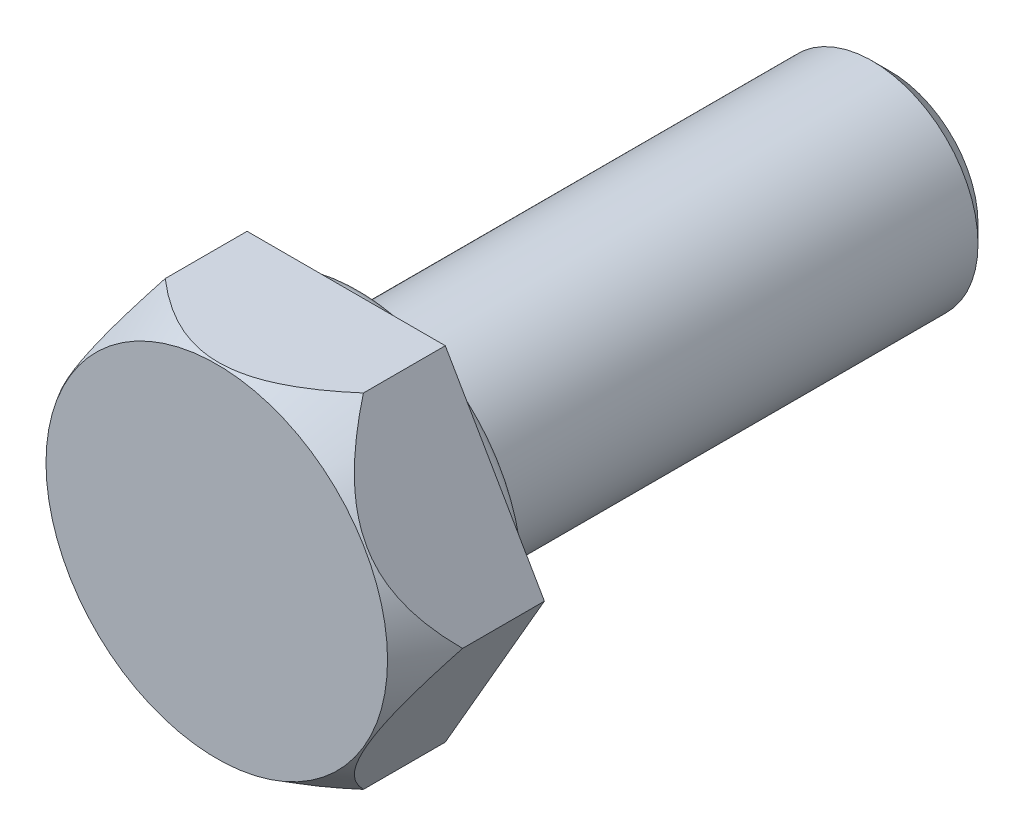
ISO-10303-21;
HEADER;
FILE_DESCRIPTION(('STEP AP214'),'2;1');
FILE_NAME('part.step','',(''),(''),'','','');
FILE_SCHEMA(('AUTOMOTIVE_DESIGN { 1 0 10303 214 1 1 1 1 }'));
ENDSEC;
DATA;
#1=APPLICATION_CONTEXT('core data for automotive mechanical design processes');
#2=APPLICATION_PROTOCOL_DEFINITION('international standard','automotive_design',2000,#1);
#3=PRODUCT_CONTEXT('',#1,'mechanical');
#4=PRODUCT('Part','Part','',(#3));
#5=PRODUCT_RELATED_PRODUCT_CATEGORY('part','',(#4));
#6=PRODUCT_DEFINITION_FORMATION('','',#4);
#7=PRODUCT_DEFINITION_CONTEXT('part definition',#1,'design');
#8=PRODUCT_DEFINITION('design','',#6,#7);
#9=PRODUCT_DEFINITION_SHAPE('','',#8);
#10=(LENGTH_UNIT() NAMED_UNIT(*) SI_UNIT(.MILLI.,.METRE.));
#11=(NAMED_UNIT(*) PLANE_ANGLE_UNIT() SI_UNIT($,.RADIAN.));
#12=(NAMED_UNIT(*) SI_UNIT($,.STERADIAN.) SOLID_ANGLE_UNIT());
#13=UNCERTAINTY_MEASURE_WITH_UNIT(LENGTH_MEASURE(1.E-05),#10,'distance_accuracy_value','');
#14=(GEOMETRIC_REPRESENTATION_CONTEXT(3) GLOBAL_UNCERTAINTY_ASSIGNED_CONTEXT((#13)) GLOBAL_UNIT_ASSIGNED_CONTEXT((#10,
#11,#12)) REPRESENTATION_CONTEXT('',''));
#15=CARTESIAN_POINT('',(0.,0.,0.));
#16=DIRECTION('',(0.,0.,1.));
#17=DIRECTION('',(1.,0.,0.));
#18=AXIS2_PLACEMENT_3D('',#15,#16,#17);
#19=CARTESIAN_POINT('',(0.,6.4,0.));
#20=DIRECTION('',(0.,0.,1.));
#21=DIRECTION('',(1.,0.,0.));
#22=AXIS2_PLACEMENT_3D('',#19,#20,#21);
#23=PLANE('',#22);
#24=CARTESIAN_POINT('',(0.,0.,0.));
#25=DIRECTION('',(0.,0.,1.));
#26=DIRECTION('',(1.,0.,0.));
#27=AXIS2_PLACEMENT_3D('',#24,#25,#26);
#28=CIRCLE('',#27,6.4);
#29=CARTESIAN_POINT('',(6.4,0.,0.));
#30=VERTEX_POINT('',#29);
#31=EDGE_CURVE('E259',#30,#30,#28,.T.);
#32=ORIENTED_EDGE('',*,*,#31,.T.);
#33=EDGE_LOOP('',(#32));
#34=FACE_BOUND('',#33,.T.);
#35=DIRECTION('',(-1.,0.,0.));
#36=VECTOR('',#35,1.);
#37=CARTESIAN_POINT('',(0.,-6.49999696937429,0.));
#38=LINE('',#37,#36);
#39=CARTESIAN_POINT('',(3.752775,-6.49999696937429,0.));
#40=VERTEX_POINT('',#39);
#41=CARTESIAN_POINT('',(-3.752775,-6.4999969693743,0.));
#42=VERTEX_POINT('',#41);
#43=EDGE_CURVE('E237',#40,#42,#38,.T.);
#44=ORIENTED_EDGE('',*,*,#43,.T.);
#45=DIRECTION('',(-0.5,0.866025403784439,0.));
#46=VECTOR('',#45,1.);
#47=CARTESIAN_POINT('',(-8.4004437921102,1.55000151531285,0.));
#48=LINE('',#47,#46);
#49=CARTESIAN_POINT('',(-7.50555,0.,0.));
#50=VERTEX_POINT('',#49);
#51=EDGE_CURVE('E105',#42,#50,#48,.T.);
#52=ORIENTED_EDGE('',*,*,#51,.T.);
#53=DIRECTION('',(0.5,0.866025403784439,0.));
#54=VECTOR('',#53,1.);
#55=CARTESIAN_POINT('',(-2.8578812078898,8.04999848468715,0.));
#56=LINE('',#55,#54);
#57=CARTESIAN_POINT('',(-3.752775,6.49999696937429,0.));
#58=VERTEX_POINT('',#57);
#59=EDGE_CURVE('E249',#50,#58,#56,.T.);
#60=ORIENTED_EDGE('',*,*,#59,.T.);
#61=DIRECTION('',(1.,0.,0.));
#62=VECTOR('',#61,1.);
#63=CARTESIAN_POINT('',(0.,6.4999969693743,0.));
#64=LINE('',#63,#62);
#65=CARTESIAN_POINT('',(3.752775,6.4999969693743,0.));
#66=VERTEX_POINT('',#65);
#67=EDGE_CURVE('E245',#58,#66,#64,.T.);
#68=ORIENTED_EDGE('',*,*,#67,.T.);
#69=DIRECTION('',(0.5,-0.866025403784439,0.));
#70=VECTOR('',#69,1.);
#71=CARTESIAN_POINT('',(2.8578812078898,8.04999848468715,0.));
#72=LINE('',#71,#70);
#73=CARTESIAN_POINT('',(7.50555,0.,0.));
#74=VERTEX_POINT('',#73);
#75=EDGE_CURVE('E242',#66,#74,#72,.T.);
#76=ORIENTED_EDGE('',*,*,#75,.T.);
#77=DIRECTION('',(-0.5,-0.866025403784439,0.));
#78=VECTOR('',#77,1.);
#79=CARTESIAN_POINT('',(8.4004437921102,1.55000151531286,0.));
#80=LINE('',#79,#78);
#81=EDGE_CURVE('E222',#74,#40,#80,.T.);
#82=ORIENTED_EDGE('',*,*,#81,.T.);
#83=EDGE_LOOP('',(#44,#52,#60,#68,#76,#82));
#84=FACE_BOUND('',#83,.T.);
#85=ADVANCED_FACE('F16',(#34,#84),#23,.F.);
#86=CARTESIAN_POINT('',(0.,0.,-20.6));
#87=DIRECTION('',(0.,0.,1.));
#88=DIRECTION('',(1.,0.,0.));
#89=AXIS2_PLACEMENT_3D('',#86,#87,#88);
#90=PLANE('',#89);
#91=CARTESIAN_POINT('',(0.,0.,-20.6));
#92=DIRECTION('',(0.,0.,1.));
#93=DIRECTION('',(1.,0.,0.));
#94=AXIS2_PLACEMENT_3D('',#91,#92,#93);
#95=CIRCLE('',#94,3.3234375);
#96=CARTESIAN_POINT('',(3.3234375,0.,-20.6));
#97=VERTEX_POINT('',#96);
#98=EDGE_CURVE('E98',#97,#97,#95,.T.);
#99=ORIENTED_EDGE('',*,*,#98,.F.);
#100=EDGE_LOOP('',(#99));
#101=FACE_BOUND('',#100,.T.);
#102=ADVANCED_FACE('F151',(#101),#90,.F.);
#103=CARTESIAN_POINT('',(0.,0.,-20.6));
#104=DIRECTION('',(0.,0.,1.));
#105=DIRECTION('',(1.,0.,0.));
#106=AXIS2_PLACEMENT_3D('',#103,#104,#105);
#107=CONICAL_SURFACE('',#106,3.3234375,0.785398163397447);
#108=CARTESIAN_POINT('',(0.,0.,-19.9234375));
#109=DIRECTION('',(0.,0.,1.));
#110=DIRECTION('',(1.,0.,0.));
#111=AXIS2_PLACEMENT_3D('',#108,#109,#110);
#112=CIRCLE('',#111,4.);
#113=CARTESIAN_POINT('',(4.,0.,-19.9234375));
#114=VERTEX_POINT('',#113);
#115=EDGE_CURVE('E179',#114,#114,#112,.T.);
#116=ORIENTED_EDGE('',*,*,#115,.F.);
#117=EDGE_LOOP('',(#116));
#118=FACE_BOUND('',#117,.T.);
#119=ORIENTED_EDGE('',*,*,#98,.T.);
#120=EDGE_LOOP('',(#119));
#121=FACE_BOUND('',#120,.T.);
#122=ADVANCED_FACE('F156',(#118,#121),#107,.T.);
#123=CARTESIAN_POINT('',(0.,0.,4.9));
#124=DIRECTION('',(0.,0.,1.));
#125=DIRECTION('',(1.,0.,0.));
#126=AXIS2_PLACEMENT_3D('',#123,#124,#125);
#127=CYLINDRICAL_SURFACE('',#126,4.);
#128=CARTESIAN_POINT('',(0.,0.,-1.));
#129=DIRECTION('',(0.,0.,1.));
#130=DIRECTION('',(1.,0.,0.));
#131=AXIS2_PLACEMENT_3D('',#128,#129,#130);
#132=CIRCLE('',#131,4.);
#133=CARTESIAN_POINT('',(4.,0.,-1.));
#134=VERTEX_POINT('',#133);
#135=EDGE_CURVE('E188',#134,#134,#132,.T.);
#136=ORIENTED_EDGE('',*,*,#135,.F.);
#137=EDGE_LOOP('',(#136));
#138=FACE_BOUND('',#137,.T.);
#139=ORIENTED_EDGE('',*,*,#115,.T.);
#140=EDGE_LOOP('',(#139));
#141=FACE_BOUND('',#140,.T.);
#142=ADVANCED_FACE('F167',(#138,#141),#127,.T.);
#143=CARTESIAN_POINT('',(0.,0.,-1.));
#144=DIRECTION('',(0.,0.,1.));
#145=DIRECTION('',(1.,0.,0.));
#146=AXIS2_PLACEMENT_3D('',#143,#144,#145);
#147=TOROIDAL_SURFACE('',#146,4.4,0.4);
#148=ORIENTED_EDGE('',*,*,#135,.T.);
#149=EDGE_LOOP('',(#148));
#150=FACE_BOUND('',#149,.T.);
#151=CARTESIAN_POINT('',(0.,0.,-0.6));
#152=DIRECTION('',(0.,0.,1.));
#153=DIRECTION('',(1.,0.,0.));
#154=AXIS2_PLACEMENT_3D('',#151,#152,#153);
#155=CIRCLE('',#154,4.4);
#156=CARTESIAN_POINT('',(4.4,0.,-0.6));
#157=VERTEX_POINT('',#156);
#158=EDGE_CURVE('E265',#157,#157,#155,.T.);
#159=ORIENTED_EDGE('',*,*,#158,.F.);
#160=EDGE_LOOP('',(#159));
#161=FACE_BOUND('',#160,.T.);
#162=ADVANCED_FACE('F163',(#150,#161),#147,.F.);
#163=CARTESIAN_POINT('',(0.,4.4,-0.6));
#164=DIRECTION('',(0.,0.,1.));
#165=DIRECTION('',(1.,0.,0.));
#166=AXIS2_PLACEMENT_3D('',#163,#164,#165);
#167=PLANE('',#166);
#168=CARTESIAN_POINT('',(0.,0.,-0.6));
#169=DIRECTION('',(0.,0.,1.));
#170=DIRECTION('',(1.,0.,0.));
#171=AXIS2_PLACEMENT_3D('',#168,#169,#170);
#172=CIRCLE('',#171,5.8);
#173=CARTESIAN_POINT('',(5.8,0.,-0.6));
#174=VERTEX_POINT('',#173);
#175=EDGE_CURVE('E261',#174,#174,#172,.T.);
#176=ORIENTED_EDGE('',*,*,#175,.F.);
#177=EDGE_LOOP('',(#176));
#178=FACE_BOUND('',#177,.T.);
#179=ORIENTED_EDGE('',*,*,#158,.T.);
#180=EDGE_LOOP('',(#179));
#181=FACE_BOUND('',#180,.T.);
#182=ADVANCED_FACE('F147',(#178,#181),#167,.F.);
#183=CARTESIAN_POINT('',(0.,0.,0.));
#184=DIRECTION('',(0.,0.,1.));
#185=DIRECTION('',(1.,0.,0.));
#186=AXIS2_PLACEMENT_3D('',#183,#184,#185);
#187=TOROIDAL_SURFACE('',#186,5.8,0.6);
#188=ORIENTED_EDGE('',*,*,#31,.F.);
#189=EDGE_LOOP('',(#188));
#190=FACE_BOUND('',#189,.T.);
#191=ORIENTED_EDGE('',*,*,#175,.T.);
#192=EDGE_LOOP('',(#191));
#193=FACE_BOUND('',#192,.T.);
#194=ADVANCED_FACE('F142',(#190,#193),#187,.T.);
#195=CARTESIAN_POINT('',(-3.752775,-6.4999969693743,-20.6));
#196=DIRECTION('',(0.866025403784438,0.5,0.));
#197=DIRECTION('',(0.5,-0.866025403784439,0.));
#198=AXIS2_PLACEMENT_3D('',#195,#196,#197);
#199=PLANE('',#198);
#200=ORIENTED_EDGE('',*,*,#51,.F.);
#201=DIRECTION('',(0.,0.,1.));
#202=VECTOR('',#201,1.);
#203=CARTESIAN_POINT('',(-3.752775,-6.4999969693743,-20.6));
#204=LINE('',#203,#202);
#205=CARTESIAN_POINT('',(-3.752775,-6.4999969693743,3.1));
#206=VERTEX_POINT('',#205);
#207=EDGE_CURVE('E42',#42,#206,#204,.T.);
#208=ORIENTED_EDGE('',*,*,#207,.T.);
#209=CARTESIAN_POINT('',(-7.50555115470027,1.99999953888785E-06,3.099998));
#210=CARTESIAN_POINT('',(-7.46629983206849,-0.0679832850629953,3.16797634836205));
#211=CARTESIAN_POINT('',(-7.42665683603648,-0.136646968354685,3.23504790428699));
#212=CARTESIAN_POINT('',(-7.34650128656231,-0.275480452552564,3.36712464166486));
#213=CARTESIAN_POINT('',(-7.30598848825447,-0.345650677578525,3.43212922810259));
#214=CARTESIAN_POINT('',(-7.18263245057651,-0.559309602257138,3.624255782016));
#215=CARTESIAN_POINT('',(-7.0983699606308,-0.70525651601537,3.74779218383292));
#216=CARTESIAN_POINT('',(-6.92328544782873,-1.008511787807,3.98525037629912));
#217=CARTESIAN_POINT('',(-6.83235020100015,-1.16601625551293,4.09884132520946));
#218=CARTESIAN_POINT('',(-6.64555360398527,-1.48955745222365,4.30791459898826));
#219=CARTESIAN_POINT('',(-6.54970376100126,-1.65557425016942,4.4034369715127));
#220=CARTESIAN_POINT('',(-6.3977890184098,-1.9186983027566,4.53249561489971));
#221=CARTESIAN_POINT('',(-6.343502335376,-2.01272559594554,4.57444053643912));
#222=CARTESIAN_POINT('',(-6.23350734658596,-2.20324250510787,4.65019797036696));
#223=CARTESIAN_POINT('',(-6.17779893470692,-2.29973230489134,4.68400987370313));
#224=CARTESIAN_POINT('',(-6.06562539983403,-2.49402256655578,4.74220859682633));
#225=CARTESIAN_POINT('',(-6.00916975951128,-2.59180660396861,4.76666791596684));
#226=CARTESIAN_POINT('',(-5.89540917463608,-2.78884571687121,4.80565421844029));
#227=CARTESIAN_POINT('',(-5.83810439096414,-2.88810051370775,4.82018305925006));
#228=CARTESIAN_POINT('',(-5.72253588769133,-3.08827103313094,4.83881419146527));
#229=CARTESIAN_POINT('',(-5.66426819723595,-3.18919363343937,4.84281920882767));
#230=CARTESIAN_POINT('',(-5.54780120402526,-3.39092038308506,4.8399485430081));
#231=CARTESIAN_POINT('',(-5.48960190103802,-3.49172453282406,4.83307289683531));
#232=CARTESIAN_POINT('',(-5.37363854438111,-3.69257895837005,4.80870962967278));
#233=CARTESIAN_POINT('',(-5.31587571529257,-3.79262711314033,4.79119892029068));
#234=CARTESIAN_POINT('',(-5.20130242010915,-3.99107388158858,4.74624030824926));
#235=CARTESIAN_POINT('',(-5.14449254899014,-4.08947146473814,4.71878642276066));
#236=CARTESIAN_POINT('',(-5.01593603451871,-4.31213787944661,4.64568121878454));
#237=CARTESIAN_POINT('',(-4.94461117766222,-4.43567615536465,4.59706464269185));
#238=CARTESIAN_POINT('',(-4.80442067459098,-4.67849322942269,4.4872333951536));
#239=CARTESIAN_POINT('',(-4.73555657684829,-4.7977693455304,4.42601094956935));
#240=CARTESIAN_POINT('',(-4.60012006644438,-5.03235226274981,4.29295380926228));
#241=CARTESIAN_POINT('',(-4.53355801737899,-5.14764111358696,4.22107730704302));
#242=CARTESIAN_POINT('',(-4.40293794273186,-5.37388171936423,4.06886648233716));
#243=CARTESIAN_POINT('',(-4.33887950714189,-5.48483418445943,3.9885335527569));
#244=CARTESIAN_POINT('',(-4.18381356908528,-5.7534162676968,3.78206900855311));
#245=CARTESIAN_POINT('',(-4.09411640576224,-5.90877631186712,3.65200268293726));
#246=CARTESIAN_POINT('',(-3.96327273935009,-6.13540418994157,3.44953049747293));
#247=CARTESIAN_POINT('',(-3.9205066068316,-6.20947730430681,3.38121734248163));
#248=CARTESIAN_POINT('',(-3.83594062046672,-6.35594988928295,3.24227150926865));
#249=CARTESIAN_POINT('',(-3.79414056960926,-6.42834970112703,3.17163931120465));
#250=CARTESIAN_POINT('',(-3.75277384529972,-6.49999896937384,3.099998));
#251=B_SPLINE_CURVE_WITH_KNOTS('',3,(#209,#210,#211,#212,#213,#214,#215,#216,#217,#218,#219,
#220,#221,#222,#223,#224,#225,#226,#227,#228,#229,#230,#231,#232,#233,#234,#235,#236,#237,#238,
#239,#240,#241,#242,#243,#244,#245,#246,#247,#248,#249,#250),.UNSPECIFIED.,.F.,.F.,(4,2,2,2,2,2,
2,2,2,2,2,2,2,2,2,2,2,2,2,2,4),(0.,0.311519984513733,0.623128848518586,1.24952093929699,
1.89209564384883,2.53322899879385,2.88214670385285,3.23109052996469,3.57727175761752,
3.92338821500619,4.27269282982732,4.62199625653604,4.97206073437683,5.32233619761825,
5.77371777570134,6.22537856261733,6.67886107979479,7.1322690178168,7.79638121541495,
8.12474701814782,8.45304525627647),.UNSPECIFIED.);
#252=CARTESIAN_POINT('',(-7.50555,0.,3.1));
#253=VERTEX_POINT('',#252);
#254=EDGE_CURVE('E10',#253,#206,#251,.T.);
#255=ORIENTED_EDGE('',*,*,#254,.F.);
#256=DIRECTION('',(0.,0.,1.));
#257=VECTOR('',#256,1.);
#258=CARTESIAN_POINT('',(-7.50555,0.,-20.6));
#259=LINE('',#258,#257);
#260=EDGE_CURVE('E234',#50,#253,#259,.T.);
#261=ORIENTED_EDGE('',*,*,#260,.F.);
#262=EDGE_LOOP('',(#200,#208,#255,#261));
#263=FACE_BOUND('',#262,.T.);
#264=ADVANCED_FACE('F101',(#263),#199,.F.);
#265=CARTESIAN_POINT('',(-7.50555,0.,-20.6));
#266=DIRECTION('',(0.866025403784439,-0.5,0.));
#267=DIRECTION('',(-0.5,-0.866025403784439,0.));
#268=AXIS2_PLACEMENT_3D('',#265,#266,#267);
#269=PLANE('',#268);
#270=ORIENTED_EDGE('',*,*,#59,.F.);
#271=ORIENTED_EDGE('',*,*,#260,.T.);
#272=CARTESIAN_POINT('',(-3.75277384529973,6.49999896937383,3.099998));
#273=CARTESIAN_POINT('',(-3.79202516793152,6.4320136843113,3.16797634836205));
#274=CARTESIAN_POINT('',(-3.83166816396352,6.36335000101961,3.235047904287));
#275=CARTESIAN_POINT('',(-3.9118237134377,6.22451651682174,3.36712464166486));
#276=CARTESIAN_POINT('',(-3.95233651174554,6.15434629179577,3.43212922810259));
#277=CARTESIAN_POINT('',(-4.0756925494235,5.94068736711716,3.62425578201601));
#278=CARTESIAN_POINT('',(-4.15995503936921,5.79474045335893,3.74779218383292));
#279=CARTESIAN_POINT('',(-4.33503955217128,5.49148518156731,3.98525037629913));
#280=CARTESIAN_POINT('',(-4.42597479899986,5.33398071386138,4.09884132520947));
#281=CARTESIAN_POINT('',(-4.61277139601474,5.01043951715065,4.30791459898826));
#282=CARTESIAN_POINT('',(-4.70862123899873,4.84442271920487,4.40343697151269));
#283=CARTESIAN_POINT('',(-4.8605359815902,4.5812986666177,4.5324956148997));
#284=CARTESIAN_POINT('',(-4.91482266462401,4.48727137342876,4.57444053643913));
#285=CARTESIAN_POINT('',(-5.02481765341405,4.29675446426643,4.65019797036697));
#286=CARTESIAN_POINT('',(-5.08052606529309,4.20026466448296,4.68400987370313));
#287=CARTESIAN_POINT('',(-5.19269960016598,4.00597440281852,4.74220859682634));
#288=CARTESIAN_POINT('',(-5.24915524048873,3.90819036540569,4.76666791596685));
#289=CARTESIAN_POINT('',(-5.36291582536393,3.71115125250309,4.8056542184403));
#290=CARTESIAN_POINT('',(-5.42022060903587,3.61189645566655,4.82018305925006));
#291=CARTESIAN_POINT('',(-5.53578911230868,3.41172593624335,4.83881419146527));
#292=CARTESIAN_POINT('',(-5.59405680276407,3.31080333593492,4.84281920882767));
#293=CARTESIAN_POINT('',(-5.71052379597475,3.10907658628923,4.83994854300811));
#294=CARTESIAN_POINT('',(-5.76872309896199,3.00827243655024,4.83307289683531));
#295=CARTESIAN_POINT('',(-5.8846864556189,2.80741801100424,4.80870962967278));
#296=CARTESIAN_POINT('',(-5.94244928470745,2.70736985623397,4.79119892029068));
#297=CARTESIAN_POINT('',(-6.05702257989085,2.50892308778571,4.74624030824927));
#298=CARTESIAN_POINT('',(-6.11383245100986,2.41052550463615,4.71878642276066));
#299=CARTESIAN_POINT('',(-6.24238896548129,2.18785908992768,4.64568121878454));
#300=CARTESIAN_POINT('',(-6.31371382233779,2.06432081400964,4.59706464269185));
#301=CARTESIAN_POINT('',(-6.45390432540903,1.8215037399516,4.4872333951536));
#302=CARTESIAN_POINT('',(-6.52276842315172,1.70222762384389,4.42601094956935));
#303=CARTESIAN_POINT('',(-6.65820493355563,1.46764470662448,4.29295380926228));
#304=CARTESIAN_POINT('',(-6.72476698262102,1.35235585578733,4.22107730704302));
#305=CARTESIAN_POINT('',(-6.85538705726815,1.12611525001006,4.06886648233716));
#306=CARTESIAN_POINT('',(-6.91944549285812,1.01516278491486,3.98853355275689));
#307=CARTESIAN_POINT('',(-7.07451143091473,0.746580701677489,3.7820690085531));
#308=CARTESIAN_POINT('',(-7.16420859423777,0.591220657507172,3.65200268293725));
#309=CARTESIAN_POINT('',(-7.29505226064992,0.364592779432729,3.44953049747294));
#310=CARTESIAN_POINT('',(-7.33781839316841,0.290519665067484,3.38121734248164));
#311=CARTESIAN_POINT('',(-7.42238437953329,0.144047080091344,3.24227150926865));
#312=CARTESIAN_POINT('',(-7.46418443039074,0.0716472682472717,3.17163931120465));
#313=CARTESIAN_POINT('',(-7.50555115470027,-1.99999953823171E-06,3.099998));
#314=B_SPLINE_CURVE_WITH_KNOTS('',3,(#272,#273,#274,#275,#276,#277,#278,#279,#280,#281,#282,
#283,#284,#285,#286,#287,#288,#289,#290,#291,#292,#293,#294,#295,#296,#297,#298,#299,#300,#301,
#302,#303,#304,#305,#306,#307,#308,#309,#310,#311,#312,#313),.UNSPECIFIED.,.F.,.F.,(4,2,2,2,2,2,
2,2,2,2,2,2,2,2,2,2,2,2,2,2,4),(0.,0.311519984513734,0.623128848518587,1.24952093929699,
1.89209564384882,2.53322899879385,2.88214670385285,3.23109052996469,3.57727175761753,
3.9233882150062,4.27269282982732,4.62199625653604,4.97206073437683,5.32233619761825,
5.77371777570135,6.22537856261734,6.6788610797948,7.13226901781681,7.79638121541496,
8.12474701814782,8.45304525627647),.UNSPECIFIED.);
#315=CARTESIAN_POINT('',(-3.752775,6.49999696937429,3.1));
#316=VERTEX_POINT('',#315);
#317=EDGE_CURVE('E30',#316,#253,#314,.T.);
#318=ORIENTED_EDGE('',*,*,#317,.F.);
#319=DIRECTION('',(0.,0.,1.));
#320=VECTOR('',#319,1.);
#321=CARTESIAN_POINT('',(-3.752775,6.49999696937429,-20.6));
#322=LINE('',#321,#320);
#323=EDGE_CURVE('E229',#58,#316,#322,.T.);
#324=ORIENTED_EDGE('',*,*,#323,.F.);
#325=EDGE_LOOP('',(#270,#271,#318,#324));
#326=FACE_BOUND('',#325,.T.);
#327=ADVANCED_FACE('F134',(#326),#269,.F.);
#328=CARTESIAN_POINT('',(-3.752775,6.49999696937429,-20.6));
#329=DIRECTION('',(0.,-1.,0.));
#330=DIRECTION('',(-1.,0.,0.));
#331=AXIS2_PLACEMENT_3D('',#328,#329,#330);
#332=PLANE('',#331);
#333=ORIENTED_EDGE('',*,*,#67,.F.);
#334=ORIENTED_EDGE('',*,*,#323,.T.);
#335=CARTESIAN_POINT('',(-6.52280699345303,6.49999696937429,0.15035710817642));
#336=CARTESIAN_POINT('',(-6.38753084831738,6.49999696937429,0.316289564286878));
#337=CARTESIAN_POINT('',(-6.25102197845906,6.49999696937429,0.481232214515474));
#338=CARTESIAN_POINT('',(-5.97506181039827,6.49999696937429,0.808710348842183));
#339=CARTESIAN_POINT('',(-5.83560973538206,6.49999696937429,0.97124517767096));
#340=CARTESIAN_POINT('',(-5.55204366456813,6.49999696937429,1.29489103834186));
#341=CARTESIAN_POINT('',(-5.4078983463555,6.49999696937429,1.45597471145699));
#342=CARTESIAN_POINT('',(-5.11563612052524,6.49999696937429,1.77447985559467));
#343=CARTESIAN_POINT('',(-4.96751958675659,6.49999696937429,1.93190166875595));
#344=CARTESIAN_POINT('',(-4.65691681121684,6.49999696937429,2.25222162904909));
#345=CARTESIAN_POINT('',(-4.49411947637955,6.49999696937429,2.41481949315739));
#346=CARTESIAN_POINT('',(-4.16215243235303,6.49999696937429,2.73350194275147));
#347=CARTESIAN_POINT('',(-3.99298112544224,6.49999696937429,2.88958487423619));
#348=CARTESIAN_POINT('',(-3.64772754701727,6.49999696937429,3.19257741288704));
#349=CARTESIAN_POINT('',(-3.47167461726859,6.49999696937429,3.33952024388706));
#350=CARTESIAN_POINT('',(-3.11068304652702,6.49999696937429,3.62196877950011));
#351=CARTESIAN_POINT('',(-2.92575052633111,6.49999696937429,3.75748218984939));
#352=CARTESIAN_POINT('',(-2.61064659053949,6.49999696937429,3.96918045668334));
#353=CARTESIAN_POINT('',(-2.48344395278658,6.49999696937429,4.04977445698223));
#354=CARTESIAN_POINT('',(-2.22408042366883,6.49999696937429,4.2027316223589));
#355=CARTESIAN_POINT('',(-2.09191794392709,6.49999696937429,4.27509212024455));
#356=CARTESIAN_POINT('',(-1.82376168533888,6.49999696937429,4.40900404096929));
#357=CARTESIAN_POINT('',(-1.68781668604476,6.49999696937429,4.47065229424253));
#358=CARTESIAN_POINT('',(-1.41104011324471,6.49999696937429,4.58180293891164));
#359=CARTESIAN_POINT('',(-1.27021079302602,6.49999696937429,4.63131084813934));
#360=CARTESIAN_POINT('',(-1.02152860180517,6.49999696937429,4.70491288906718));
#361=CARTESIAN_POINT('',(-0.914639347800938,6.49999696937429,4.73226771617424));
#362=CARTESIAN_POINT('',(-0.69901159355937,6.49999696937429,4.77827029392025));
#363=CARTESIAN_POINT('',(-0.590273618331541,6.49999696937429,4.79692047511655));
#364=CARTESIAN_POINT('',(-0.371615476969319,6.49999696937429,4.82486510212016));
#365=CARTESIAN_POINT('',(-0.261695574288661,6.49999696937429,4.83416159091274));
#366=CARTESIAN_POINT('',(-0.0414583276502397,6.49999696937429,4.84305482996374));
#367=CARTESIAN_POINT('',(0.0688590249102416,6.4999969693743,4.84265136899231));
#368=CARTESIAN_POINT('',(0.28897518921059,6.4999969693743,4.83215808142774));
#369=CARTESIAN_POINT('',(0.398774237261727,6.49999696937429,4.82207320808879));
#370=CARTESIAN_POINT('',(0.617134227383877,6.49999696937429,4.79261553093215));
#371=CARTESIAN_POINT('',(0.725694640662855,6.49999696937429,4.7732389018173));
#372=CARTESIAN_POINT('',(1.04856246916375,6.49999696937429,4.70209857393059));
#373=CARTESIAN_POINT('',(1.2600854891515,6.4999969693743,4.63732277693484));
#374=CARTESIAN_POINT('',(1.62992332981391,6.4999969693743,4.49643063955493));
#375=CARTESIAN_POINT('',(1.79025807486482,6.49999696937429,4.42535961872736));
#376=CARTESIAN_POINT('',(2.1041253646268,6.49999696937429,4.26934812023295));
#377=CARTESIAN_POINT('',(2.2576531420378,6.49999696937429,4.18439811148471));
#378=CARTESIAN_POINT('',(2.55975925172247,6.49999696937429,4.00263691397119));
#379=CARTESIAN_POINT('',(2.70826410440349,6.49999696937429,3.90570498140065));
#380=CARTESIAN_POINT('',(2.92639514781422,6.49999696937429,3.75382056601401));
#381=CARTESIAN_POINT('',(2.99832114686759,6.49999696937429,3.70212184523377));
#382=CARTESIAN_POINT('',(3.14073898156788,6.49999696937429,3.59678764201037));
#383=CARTESIAN_POINT('',(3.21123085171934,6.4999969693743,3.54315220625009));
#384=CARTESIAN_POINT('',(3.43349967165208,6.4999969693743,3.36967592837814));
#385=CARTESIAN_POINT('',(3.58275558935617,6.49999696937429,3.24659665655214));
#386=CARTESIAN_POINT('',(3.87577002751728,6.49999696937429,2.99403182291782));
#387=CARTESIAN_POINT('',(4.01952690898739,6.49999696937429,2.86454437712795));
#388=CARTESIAN_POINT('',(4.30242753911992,6.49999696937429,2.60036720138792));
#389=CARTESIAN_POINT('',(4.44156659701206,6.49999696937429,2.46567246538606));
#390=CARTESIAN_POINT('',(4.71576056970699,6.49999696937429,2.19217588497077));
#391=CARTESIAN_POINT('',(4.85081505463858,6.49999696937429,2.05337361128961));
#392=CARTESIAN_POINT('',(5.11813739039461,6.49999696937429,1.77163295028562));
#393=CARTESIAN_POINT('',(5.25038530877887,6.49999696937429,1.6286756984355));
#394=CARTESIAN_POINT('',(5.51178391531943,6.49999696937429,1.33995253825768));
#395=CARTESIAN_POINT('',(5.64093445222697,6.49999696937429,1.19418649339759));
#396=CARTESIAN_POINT('',(6.02419918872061,6.49999696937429,0.753565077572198));
#397=CARTESIAN_POINT('',(6.27429200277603,6.49999696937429,0.455209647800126));
#398=CARTESIAN_POINT('',(6.74157892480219,6.49999696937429,-0.118009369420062));
#399=CARTESIAN_POINT('',(6.95956083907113,6.49999696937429,-0.392236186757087));
#400=CARTESIAN_POINT('',(7.39014500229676,6.49999696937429,-0.944944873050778));
#401=CARTESIAN_POINT('',(7.60274640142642,6.49999696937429,-1.2234274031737));
#402=CARTESIAN_POINT('',(8.02091577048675,6.49999696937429,-1.7802206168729));
#403=CARTESIAN_POINT('',(8.22653830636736,6.49999696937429,-2.05849045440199));
#404=CARTESIAN_POINT('',(8.63411321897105,6.49999696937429,-2.61758757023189));
#405=CARTESIAN_POINT('',(8.83606661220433,6.49999696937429,-2.89841410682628));
#406=CARTESIAN_POINT('',(9.03656318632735,6.4999969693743,-3.18026291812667));
#407=B_SPLINE_CURVE_WITH_KNOTS('',3,(#335,#336,#337,#338,#339,#340,#341,#342,#343,#344,#345,
#346,#347,#348,#349,#350,#351,#352,#353,#354,#355,#356,#357,#358,#359,#360,#361,#362,#363,#364,
#365,#366,#367,#368,#369,#370,#371,#372,#373,#374,#375,#376,#377,#378,#379,#380,#381,#382,#383,
#384,#385,#386,#387,#388,#389,#390,#391,#392,#393,#394,#395,#396,#397,#398,#399,#400,#401,#402,
#403,#404,#405,#406),.UNSPECIFIED.,.F.,.F.,(4,2,2,2,2,2,2,2,2,2,2,2,2,2,2,2,2,2,2,2,2,2,2,2,2,2,
2,2,2,2,2,2,2,2,2,4),(0.,0.642272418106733,1.28471652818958,1.93314400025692,2.58151064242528,
3.27163533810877,3.96193418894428,4.64955632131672,5.33671108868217,5.78822218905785,
6.23987913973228,6.68721302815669,7.13434322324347,7.46502623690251,7.79561686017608,
8.12613526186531,8.45666086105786,8.78701744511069,9.11751014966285,9.77840943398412,
10.3038539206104,10.8296607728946,11.3612804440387,11.6269886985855,11.8926905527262,
12.472806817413,13.0530946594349,13.6339549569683,14.2148761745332,14.7990629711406,
15.3832782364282,16.5509828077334,17.6018395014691,18.6528611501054,19.6908255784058,
20.7284979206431),.UNSPECIFIED.);
#408=CARTESIAN_POINT('',(3.752775,6.4999969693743,3.1));
#409=VERTEX_POINT('',#408);
#410=EDGE_CURVE('E113',#409,#316,#407,.F.);
#411=ORIENTED_EDGE('',*,*,#410,.F.);
#412=DIRECTION('',(0.,0.,1.));
#413=VECTOR('',#412,1.);
#414=CARTESIAN_POINT('',(3.752775,6.4999969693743,-20.6));
#415=LINE('',#414,#413);
#416=EDGE_CURVE('E224',#66,#409,#415,.T.);
#417=ORIENTED_EDGE('',*,*,#416,.F.);
#418=EDGE_LOOP('',(#333,#334,#411,#417));
#419=FACE_BOUND('',#418,.T.);
#420=ADVANCED_FACE('F137',(#419),#332,.F.);
#421=CARTESIAN_POINT('',(3.752775,6.4999969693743,-20.6));
#422=DIRECTION('',(-0.866025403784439,-0.5,0.));
#423=DIRECTION('',(-0.5,0.866025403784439,0.));
#424=AXIS2_PLACEMENT_3D('',#421,#422,#423);
#425=PLANE('',#424);
#426=ORIENTED_EDGE('',*,*,#75,.F.);
#427=ORIENTED_EDGE('',*,*,#416,.T.);
#428=CARTESIAN_POINT('',(7.50555115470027,-1.99999953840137E-06,3.099998));
#429=CARTESIAN_POINT('',(7.46629983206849,0.0679832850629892,3.16797634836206));
#430=CARTESIAN_POINT('',(7.42665683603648,0.136646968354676,3.235047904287));
#431=CARTESIAN_POINT('',(7.3465012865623,0.275480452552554,3.36712464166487));
#432=CARTESIAN_POINT('',(7.30598848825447,0.345650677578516,3.4321292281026));
#433=CARTESIAN_POINT('',(7.1826324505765,0.55930960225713,3.62425578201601));
#434=CARTESIAN_POINT('',(7.09836996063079,0.705256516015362,3.74779218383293));
#435=CARTESIAN_POINT('',(6.92328544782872,1.00851178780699,3.98525037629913));
#436=CARTESIAN_POINT('',(6.83235020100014,1.16601625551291,4.09884132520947));
#437=CARTESIAN_POINT('',(6.64555360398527,1.48955745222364,4.30791459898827));
#438=CARTESIAN_POINT('',(6.54970376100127,1.65557425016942,4.4034369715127));
#439=CARTESIAN_POINT('',(6.3977890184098,1.9186983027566,4.53249561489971));
#440=CARTESIAN_POINT('',(6.34350233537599,2.01272559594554,4.57444053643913));
#441=CARTESIAN_POINT('',(6.23350734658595,2.20324250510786,4.65019797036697));
#442=CARTESIAN_POINT('',(6.17779893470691,2.29973230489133,4.68400987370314));
#443=CARTESIAN_POINT('',(6.06562539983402,2.49402256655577,4.74220859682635));
#444=CARTESIAN_POINT('',(6.00916975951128,2.5918066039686,4.76666791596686));
#445=CARTESIAN_POINT('',(5.89540917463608,2.7888457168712,4.8056542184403));
#446=CARTESIAN_POINT('',(5.83810439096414,2.88810051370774,4.82018305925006));
#447=CARTESIAN_POINT('',(5.72253588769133,3.08827103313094,4.83881419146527));
#448=CARTESIAN_POINT('',(5.66426819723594,3.18919363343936,4.84281920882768));
#449=CARTESIAN_POINT('',(5.54780120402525,3.39092038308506,4.83994854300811));
#450=CARTESIAN_POINT('',(5.48960190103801,3.49172453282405,4.83307289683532));
#451=CARTESIAN_POINT('',(5.3736385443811,3.69257895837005,4.80870962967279));
#452=CARTESIAN_POINT('',(5.31587571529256,3.79262711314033,4.79119892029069));
#453=CARTESIAN_POINT('',(5.20130242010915,3.99107388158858,4.74624030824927));
#454=CARTESIAN_POINT('',(5.14449254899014,4.08947146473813,4.71878642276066));
#455=CARTESIAN_POINT('',(5.01593603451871,4.31213787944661,4.64568121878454));
#456=CARTESIAN_POINT('',(4.94461117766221,4.43567615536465,4.59706464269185));
#457=CARTESIAN_POINT('',(4.80442067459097,4.67849322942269,4.48723339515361));
#458=CARTESIAN_POINT('',(4.73555657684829,4.79776934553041,4.42601094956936));
#459=CARTESIAN_POINT('',(4.60012006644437,5.03235226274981,4.29295380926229));
#460=CARTESIAN_POINT('',(4.53355801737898,5.14764111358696,4.22107730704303));
#461=CARTESIAN_POINT('',(4.40293794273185,5.37388171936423,4.06886648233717));
#462=CARTESIAN_POINT('',(4.33887950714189,5.48483418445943,3.9885335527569));
#463=CARTESIAN_POINT('',(4.18381356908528,5.7534162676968,3.7820690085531));
#464=CARTESIAN_POINT('',(4.09411640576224,5.90877631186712,3.65200268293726));
#465=CARTESIAN_POINT('',(3.96327273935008,6.13540418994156,3.44953049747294));
#466=CARTESIAN_POINT('',(3.92050660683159,6.20947730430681,3.38121734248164));
#467=CARTESIAN_POINT('',(3.83594062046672,6.35594988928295,3.24227150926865));
#468=CARTESIAN_POINT('',(3.79414056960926,6.42834970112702,3.17163931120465));
#469=CARTESIAN_POINT('',(3.75277384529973,6.49999896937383,3.099998));
#470=B_SPLINE_CURVE_WITH_KNOTS('',3,(#428,#429,#430,#431,#432,#433,#434,#435,#436,#437,#438,
#439,#440,#441,#442,#443,#444,#445,#446,#447,#448,#449,#450,#451,#452,#453,#454,#455,#456,#457,
#458,#459,#460,#461,#462,#463,#464,#465,#466,#467,#468,#469),.UNSPECIFIED.,.F.,.F.,(4,2,2,2,2,2,
2,2,2,2,2,2,2,2,2,2,2,2,2,2,4),(0.,0.311519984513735,0.62312884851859,1.24952093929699,
1.89209564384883,2.53322899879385,2.88214670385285,3.23109052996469,3.57727175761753,
3.92338821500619,4.27269282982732,4.62199625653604,4.97206073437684,5.32233619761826,
5.77371777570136,6.22537856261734,6.6788610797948,7.13226901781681,7.79638121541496,
8.12474701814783,8.45304525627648),.UNSPECIFIED.);
#471=CARTESIAN_POINT('',(7.50555,0.,3.1));
#472=VERTEX_POINT('',#471);
#473=EDGE_CURVE('E121',#472,#409,#470,.T.);
#474=ORIENTED_EDGE('',*,*,#473,.F.);
#475=DIRECTION('',(0.,0.,1.));
#476=VECTOR('',#475,1.);
#477=CARTESIAN_POINT('',(7.50555,0.,-20.6));
#478=LINE('',#477,#476);
#479=EDGE_CURVE('E221',#74,#472,#478,.T.);
#480=ORIENTED_EDGE('',*,*,#479,.F.);
#481=EDGE_LOOP('',(#426,#427,#474,#480));
#482=FACE_BOUND('',#481,.T.);
#483=ADVANCED_FACE('F205',(#482),#425,.F.);
#484=CARTESIAN_POINT('',(7.50555,0.,-20.6));
#485=DIRECTION('',(-0.866025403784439,0.5,0.));
#486=DIRECTION('',(0.5,0.866025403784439,0.));
#487=AXIS2_PLACEMENT_3D('',#484,#485,#486);
#488=PLANE('',#487);
#489=ORIENTED_EDGE('',*,*,#81,.F.);
#490=ORIENTED_EDGE('',*,*,#479,.T.);
#491=CARTESIAN_POINT('',(3.75277384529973,-6.49999896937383,3.099998));
#492=CARTESIAN_POINT('',(3.79202516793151,-6.4320136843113,3.16797634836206));
#493=CARTESIAN_POINT('',(3.83166816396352,-6.36335000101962,3.235047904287));
#494=CARTESIAN_POINT('',(3.9118237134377,-6.22451651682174,3.36712464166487));
#495=CARTESIAN_POINT('',(3.95233651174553,-6.15434629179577,3.4321292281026));
#496=CARTESIAN_POINT('',(4.0756925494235,-5.94068736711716,3.62425578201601));
#497=CARTESIAN_POINT('',(4.15995503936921,-5.79474045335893,3.74779218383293));
#498=CARTESIAN_POINT('',(4.33503955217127,-5.49148518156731,3.98525037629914));
#499=CARTESIAN_POINT('',(4.42597479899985,-5.33398071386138,4.09884132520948));
#500=CARTESIAN_POINT('',(4.61277139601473,-5.01043951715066,4.30791459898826));
#501=CARTESIAN_POINT('',(4.70862123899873,-4.84442271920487,4.40343697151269));
#502=CARTESIAN_POINT('',(4.8605359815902,-4.5812986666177,4.5324956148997));
#503=CARTESIAN_POINT('',(4.914822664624,-4.48727137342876,4.57444053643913));
#504=CARTESIAN_POINT('',(5.02481765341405,-4.29675446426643,4.65019797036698));
#505=CARTESIAN_POINT('',(5.08052606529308,-4.20026466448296,4.68400987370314));
#506=CARTESIAN_POINT('',(5.19269960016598,-4.00597440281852,4.74220859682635));
#507=CARTESIAN_POINT('',(5.24915524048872,-3.90819036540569,4.76666791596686));
#508=CARTESIAN_POINT('',(5.36291582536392,-3.71115125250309,4.80565421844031));
#509=CARTESIAN_POINT('',(5.42022060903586,-3.61189645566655,4.82018305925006));
#510=CARTESIAN_POINT('',(5.53578911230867,-3.41172593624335,4.83881419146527));
#511=CARTESIAN_POINT('',(5.59405680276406,-3.31080333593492,4.84281920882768));
#512=CARTESIAN_POINT('',(5.71052379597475,-3.10907658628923,4.83994854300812));
#513=CARTESIAN_POINT('',(5.76872309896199,-3.00827243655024,4.83307289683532));
#514=CARTESIAN_POINT('',(5.8846864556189,-2.80741801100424,4.80870962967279));
#515=CARTESIAN_POINT('',(5.94244928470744,-2.70736985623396,4.7911989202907));
#516=CARTESIAN_POINT('',(6.05702257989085,-2.50892308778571,4.74624030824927));
#517=CARTESIAN_POINT('',(6.11383245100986,-2.41052550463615,4.71878642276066));
#518=CARTESIAN_POINT('',(6.24238896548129,-2.18785908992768,4.64568121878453));
#519=CARTESIAN_POINT('',(6.31371382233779,-2.06432081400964,4.59706464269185));
#520=CARTESIAN_POINT('',(6.45390432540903,-1.8215037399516,4.48723339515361));
#521=CARTESIAN_POINT('',(6.52276842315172,-1.70222762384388,4.42601094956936));
#522=CARTESIAN_POINT('',(6.65820493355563,-1.46764470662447,4.29295380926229));
#523=CARTESIAN_POINT('',(6.72476698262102,-1.35235585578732,4.22107730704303));
#524=CARTESIAN_POINT('',(6.85538705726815,-1.12611525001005,4.06886648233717));
#525=CARTESIAN_POINT('',(6.91944549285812,-1.01516278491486,3.9885335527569));
#526=CARTESIAN_POINT('',(7.07451143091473,-0.74658070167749,3.7820690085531));
#527=CARTESIAN_POINT('',(7.16420859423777,-0.591220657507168,3.65200268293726));
#528=CARTESIAN_POINT('',(7.29505226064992,-0.364592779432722,3.44953049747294));
#529=CARTESIAN_POINT('',(7.33781839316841,-0.290519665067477,3.38121734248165));
#530=CARTESIAN_POINT('',(7.42238437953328,-0.144047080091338,3.24227150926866));
#531=CARTESIAN_POINT('',(7.46418443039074,-0.0716472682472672,3.17163931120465));
#532=CARTESIAN_POINT('',(7.50555115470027,1.99999954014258E-06,3.099998));
#533=B_SPLINE_CURVE_WITH_KNOTS('',3,(#491,#492,#493,#494,#495,#496,#497,#498,#499,#500,#501,
#502,#503,#504,#505,#506,#507,#508,#509,#510,#511,#512,#513,#514,#515,#516,#517,#518,#519,#520,
#521,#522,#523,#524,#525,#526,#527,#528,#529,#530,#531,#532),.UNSPECIFIED.,.F.,.F.,(4,2,2,2,2,2,
2,2,2,2,2,2,2,2,2,2,2,2,2,2,4),(0.,0.311519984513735,0.623128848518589,1.24952093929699,
1.89209564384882,2.53322899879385,2.88214670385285,3.23109052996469,3.57727175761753,
3.9233882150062,4.27269282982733,4.62199625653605,4.97206073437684,5.32233619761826,
5.77371777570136,6.22537856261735,6.67886107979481,7.13226901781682,7.79638121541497,
8.12474701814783,8.45304525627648),.UNSPECIFIED.);
#534=CARTESIAN_POINT('',(3.752775,-6.49999696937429,3.1));
#535=VERTEX_POINT('',#534);
#536=EDGE_CURVE('E97',#535,#472,#533,.T.);
#537=ORIENTED_EDGE('',*,*,#536,.F.);
#538=DIRECTION('',(0.,0.,1.));
#539=VECTOR('',#538,1.);
#540=CARTESIAN_POINT('',(3.752775,-6.49999696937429,-20.6));
#541=LINE('',#540,#539);
#542=EDGE_CURVE('E51',#40,#535,#541,.T.);
#543=ORIENTED_EDGE('',*,*,#542,.F.);
#544=EDGE_LOOP('',(#489,#490,#537,#543));
#545=FACE_BOUND('',#544,.T.);
#546=ADVANCED_FACE('F202',(#545),#488,.F.);
#547=CARTESIAN_POINT('',(3.752775,-6.49999696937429,-20.6));
#548=DIRECTION('',(0.,1.,0.));
#549=DIRECTION('',(1.,0.,0.));
#550=AXIS2_PLACEMENT_3D('',#547,#548,#549);
#551=PLANE('',#550);
#552=ORIENTED_EDGE('',*,*,#43,.F.);
#553=ORIENTED_EDGE('',*,*,#542,.T.);
#554=CARTESIAN_POINT('',(-6.52280699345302,-6.4999969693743,0.150357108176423));
#555=CARTESIAN_POINT('',(-6.38753084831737,-6.4999969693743,0.316289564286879));
#556=CARTESIAN_POINT('',(-6.25102197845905,-6.4999969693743,0.481232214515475));
#557=CARTESIAN_POINT('',(-5.97506181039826,-6.4999969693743,0.808710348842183));
#558=CARTESIAN_POINT('',(-5.83560973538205,-6.4999969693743,0.97124517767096));
#559=CARTESIAN_POINT('',(-5.55204366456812,-6.4999969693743,1.29489103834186));
#560=CARTESIAN_POINT('',(-5.40789834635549,-6.4999969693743,1.45597471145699));
#561=CARTESIAN_POINT('',(-5.11563612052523,-6.4999969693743,1.77447985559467));
#562=CARTESIAN_POINT('',(-4.96751958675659,-6.4999969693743,1.93190166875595));
#563=CARTESIAN_POINT('',(-4.65691681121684,-6.4999969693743,2.25222162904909));
#564=CARTESIAN_POINT('',(-4.49411947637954,-6.4999969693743,2.41481949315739));
#565=CARTESIAN_POINT('',(-4.16215243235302,-6.4999969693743,2.73350194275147));
#566=CARTESIAN_POINT('',(-3.99298112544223,-6.4999969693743,2.88958487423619));
#567=CARTESIAN_POINT('',(-3.64772754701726,-6.49999696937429,3.19257741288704));
#568=CARTESIAN_POINT('',(-3.47167461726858,-6.49999696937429,3.33952024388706));
#569=CARTESIAN_POINT('',(-3.11068304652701,-6.4999969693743,3.62196877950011));
#570=CARTESIAN_POINT('',(-2.9257505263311,-6.4999969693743,3.75748218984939));
#571=CARTESIAN_POINT('',(-2.61064659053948,-6.4999969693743,3.96918045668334));
#572=CARTESIAN_POINT('',(-2.48344395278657,-6.49999696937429,4.04977445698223));
#573=CARTESIAN_POINT('',(-2.22408042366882,-6.49999696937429,4.2027316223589));
#574=CARTESIAN_POINT('',(-2.09191794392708,-6.49999696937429,4.27509212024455));
#575=CARTESIAN_POINT('',(-1.82376168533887,-6.49999696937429,4.40900404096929));
#576=CARTESIAN_POINT('',(-1.68781668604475,-6.49999696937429,4.47065229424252));
#577=CARTESIAN_POINT('',(-1.41104011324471,-6.4999969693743,4.58180293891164));
#578=CARTESIAN_POINT('',(-1.27021079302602,-6.4999969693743,4.63131084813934));
#579=CARTESIAN_POINT('',(-1.02152860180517,-6.4999969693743,4.70491288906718));
#580=CARTESIAN_POINT('',(-0.91463934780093,-6.49999696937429,4.73226771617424));
#581=CARTESIAN_POINT('',(-0.699011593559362,-6.49999696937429,4.77827029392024));
#582=CARTESIAN_POINT('',(-0.590273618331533,-6.49999696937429,4.79692047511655));
#583=CARTESIAN_POINT('',(-0.371615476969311,-6.49999696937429,4.82486510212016));
#584=CARTESIAN_POINT('',(-0.261695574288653,-6.49999696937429,4.83416159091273));
#585=CARTESIAN_POINT('',(-0.0414583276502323,-6.49999696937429,4.84305482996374));
#586=CARTESIAN_POINT('',(0.0688590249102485,-6.49999696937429,4.84265136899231));
#587=CARTESIAN_POINT('',(0.288975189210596,-6.49999696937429,4.83215808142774));
#588=CARTESIAN_POINT('',(0.398774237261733,-6.49999696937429,4.82207320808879));
#589=CARTESIAN_POINT('',(0.617134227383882,-6.49999696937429,4.79261553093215));
#590=CARTESIAN_POINT('',(0.72569464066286,-6.49999696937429,4.77323890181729));
#591=CARTESIAN_POINT('',(1.04856246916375,-6.49999696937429,4.70209857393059));
#592=CARTESIAN_POINT('',(1.26008548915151,-6.49999696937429,4.63732277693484));
#593=CARTESIAN_POINT('',(1.62992332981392,-6.49999696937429,4.49643063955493));
#594=CARTESIAN_POINT('',(1.79025807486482,-6.49999696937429,4.42535961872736));
#595=CARTESIAN_POINT('',(2.1041253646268,-6.49999696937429,4.26934812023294));
#596=CARTESIAN_POINT('',(2.2576531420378,-6.49999696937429,4.18439811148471));
#597=CARTESIAN_POINT('',(2.55975925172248,-6.49999696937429,4.00263691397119));
#598=CARTESIAN_POINT('',(2.70826410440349,-6.49999696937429,3.90570498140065));
#599=CARTESIAN_POINT('',(2.92639514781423,-6.49999696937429,3.75382056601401));
#600=CARTESIAN_POINT('',(2.99832114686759,-6.49999696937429,3.70212184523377));
#601=CARTESIAN_POINT('',(3.14073898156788,-6.49999696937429,3.59678764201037));
#602=CARTESIAN_POINT('',(3.21123085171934,-6.49999696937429,3.5431522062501));
#603=CARTESIAN_POINT('',(3.43349967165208,-6.49999696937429,3.36967592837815));
#604=CARTESIAN_POINT('',(3.58275558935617,-6.49999696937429,3.24659665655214));
#605=CARTESIAN_POINT('',(3.87577002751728,-6.49999696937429,2.99403182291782));
#606=CARTESIAN_POINT('',(4.01952690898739,-6.49999696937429,2.86454437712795));
#607=CARTESIAN_POINT('',(4.30242753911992,-6.49999696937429,2.60036720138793));
#608=CARTESIAN_POINT('',(4.44156659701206,-6.49999696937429,2.46567246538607));
#609=CARTESIAN_POINT('',(4.71576056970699,-6.49999696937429,2.19217588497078));
#610=CARTESIAN_POINT('',(4.85081505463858,-6.49999696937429,2.05337361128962));
#611=CARTESIAN_POINT('',(5.11813739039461,-6.49999696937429,1.77163295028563));
#612=CARTESIAN_POINT('',(5.25038530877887,-6.49999696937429,1.62867569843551));
#613=CARTESIAN_POINT('',(5.51178391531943,-6.49999696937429,1.33995253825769));
#614=CARTESIAN_POINT('',(5.64093445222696,-6.49999696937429,1.1941864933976));
#615=CARTESIAN_POINT('',(6.02419918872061,-6.49999696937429,0.753565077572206));
#616=CARTESIAN_POINT('',(6.27429200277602,-6.49999696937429,0.455209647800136));
#617=CARTESIAN_POINT('',(6.74157892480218,-6.49999696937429,-0.11800936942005));
#618=CARTESIAN_POINT('',(6.95956083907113,-6.49999696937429,-0.392236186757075));
#619=CARTESIAN_POINT('',(7.39014500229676,-6.49999696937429,-0.944944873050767));
#620=CARTESIAN_POINT('',(7.60274640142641,-6.49999696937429,-1.22342740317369));
#621=CARTESIAN_POINT('',(8.02091577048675,-6.49999696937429,-1.78022061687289));
#622=CARTESIAN_POINT('',(8.22653830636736,-6.49999696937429,-2.05849045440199));
#623=CARTESIAN_POINT('',(8.63411321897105,-6.49999696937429,-2.61758757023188));
#624=CARTESIAN_POINT('',(8.83606661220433,-6.49999696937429,-2.89841410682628));
#625=CARTESIAN_POINT('',(9.03656318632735,-6.49999696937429,-3.18026291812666));
#626=B_SPLINE_CURVE_WITH_KNOTS('',3,(#554,#555,#556,#557,#558,#559,#560,#561,#562,#563,#564,
#565,#566,#567,#568,#569,#570,#571,#572,#573,#574,#575,#576,#577,#578,#579,#580,#581,#582,#583,
#584,#585,#586,#587,#588,#589,#590,#591,#592,#593,#594,#595,#596,#597,#598,#599,#600,#601,#602,
#603,#604,#605,#606,#607,#608,#609,#610,#611,#612,#613,#614,#615,#616,#617,#618,#619,#620,#621,
#622,#623,#624,#625),.UNSPECIFIED.,.F.,.F.,(4,2,2,2,2,2,2,2,2,2,2,2,2,2,2,2,2,2,2,2,2,2,2,2,2,2,
2,2,2,2,2,2,2,2,2,4),(0.,0.642272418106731,1.28471652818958,1.93314400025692,2.58151064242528,
3.27163533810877,3.96193418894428,4.64955632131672,5.33671108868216,5.78822218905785,
6.23987913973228,6.68721302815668,7.13434322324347,7.4650262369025,7.79561686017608,
8.12613526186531,8.45666086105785,8.78701744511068,9.11751014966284,9.77840943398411,
10.3038539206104,10.8296607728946,11.3612804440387,11.6269886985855,11.8926905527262,
12.472806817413,13.0530946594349,13.6339549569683,14.2148761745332,14.7990629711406,
15.3832782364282,16.5509828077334,17.601839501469,18.6528611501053,19.6908255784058,
20.7284979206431),.UNSPECIFIED.);
#627=EDGE_CURVE('E92',#206,#535,#626,.T.);
#628=ORIENTED_EDGE('',*,*,#627,.F.);
#629=ORIENTED_EDGE('',*,*,#207,.F.);
#630=EDGE_LOOP('',(#552,#553,#628,#629));
#631=FACE_BOUND('',#630,.T.);
#632=ADVANCED_FACE('F93',(#631),#551,.F.);
#633=CARTESIAN_POINT('',(0.,6.46631951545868,4.9));
#634=DIRECTION('',(0.,0.,-1.));
#635=DIRECTION('',(-1.,0.,0.));
#636=AXIS2_PLACEMENT_3D('',#633,#634,#635);
#637=PLANE('',#636);
#638=CARTESIAN_POINT('',(0.,0.,4.9));
#639=DIRECTION('',(0.,0.,1.));
#640=DIRECTION('',(1.,0.,0.));
#641=AXIS2_PLACEMENT_3D('',#638,#639,#640);
#642=CIRCLE('',#641,6.46631951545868);
#643=CARTESIAN_POINT('',(6.46631951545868,0.,4.9));
#644=VERTEX_POINT('',#643);
#645=EDGE_CURVE('E255',#644,#644,#642,.T.);
#646=ORIENTED_EDGE('',*,*,#645,.T.);
#647=EDGE_LOOP('',(#646));
#648=FACE_BOUND('',#647,.T.);
#649=ADVANCED_FACE('F18',(#648),#637,.F.);
#650=CARTESIAN_POINT('',(0.,0.,3.1));
#651=DIRECTION('',(0.,0.,-1.));
#652=DIRECTION('',(-1.,0.,0.));
#653=AXIS2_PLACEMENT_3D('',#650,#651,#652);
#654=CONICAL_SURFACE('',#653,7.50555,0.523598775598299);
#655=ORIENTED_EDGE('',*,*,#645,.F.);
#656=EDGE_LOOP('',(#655));
#657=FACE_BOUND('',#656,.T.);
#658=ORIENTED_EDGE('',*,*,#317,.T.);
#659=ORIENTED_EDGE('',*,*,#254,.T.);
#660=ORIENTED_EDGE('',*,*,#627,.T.);
#661=ORIENTED_EDGE('',*,*,#536,.T.);
#662=ORIENTED_EDGE('',*,*,#473,.T.);
#663=ORIENTED_EDGE('',*,*,#410,.T.);
#664=EDGE_LOOP('',(#658,#659,#660,#661,#662,#663));
#665=FACE_BOUND('',#664,.T.);
#666=ADVANCED_FACE('F110',(#657,#665),#654,.T.);
#667=CLOSED_SHELL('',(#85,#102,#122,#142,#162,#182,#194,#264,#327,#420,#483,#546,#632,#649,#666));
#668=MANIFOLD_SOLID_BREP('B1',#667);
#669=ADVANCED_BREP_SHAPE_REPRESENTATION('',(#18,#668),#14);
#670=SHAPE_DEFINITION_REPRESENTATION(#9,#669);
ENDSEC;
END-ISO-10303-21;
